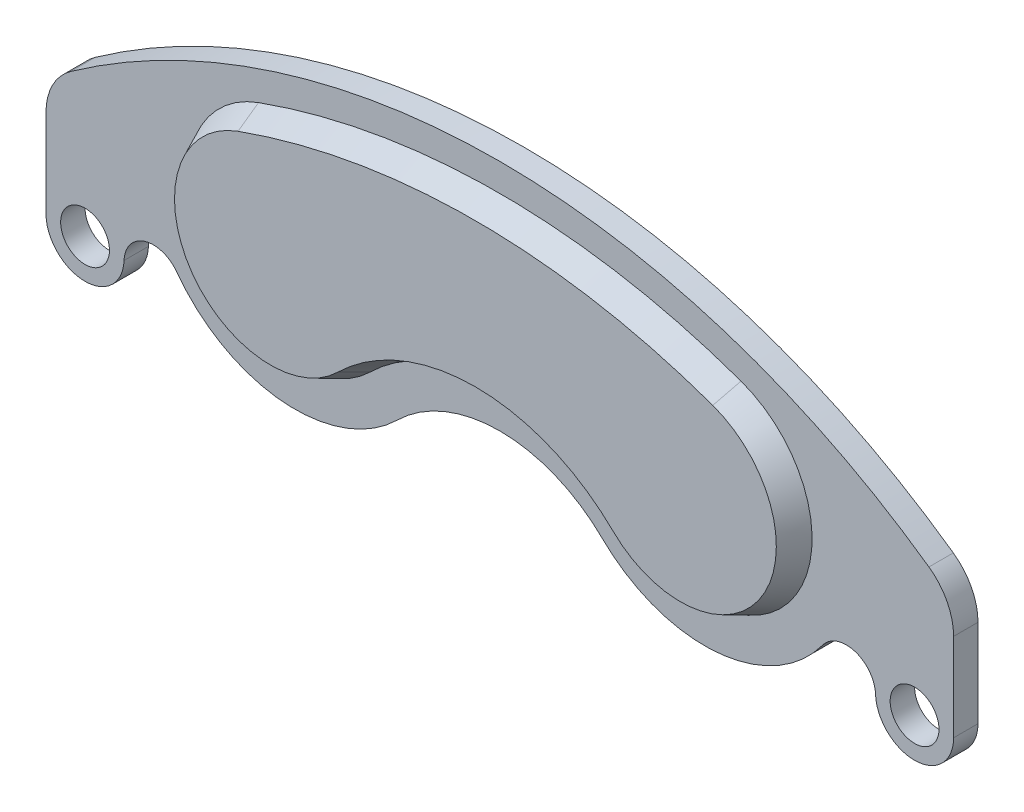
from build123d import *

# Parameters (mm, degrees)
BOSS_EXTRUDE1_DEPTH = 2.5
BOSS_EXTRUDE2_DEPTH = 2.5
BOSS_EXTRUDE2_TAPER = 25
SKETCH4_R           = 2.5
CUT_EXTRUDE1_DEPTH  = 90.131924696


with BuildPart() as part:
    # Sketch1 → Boss-Extrude1 (new body)
    with BuildSketch(Plane.XY):
        with BuildLine():
            Line((-46.5, 57.094220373), (-46.5, 48.094220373))
            ThreePointArc((-46.5, 48.094220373), (-42.572396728, 44.094875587), (-38.502620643, 47.949450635))
            ThreePointArc((-38.502620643, 47.949450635), (-36.387640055, 50.707965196), (-33.087155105, 49.617394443))
            ThreePointArc((-33.087155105, 49.617394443), (-22.211018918, 43.548965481), (-10.5, 47.787857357))
            ThreePointArc((-10.5, 47.787857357), (0, 52.075714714), (10.5, 47.787857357))
            ThreePointArc((10.5, 47.787857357), (22.211018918, 43.548965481), (33.087155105, 49.617394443))
            ThreePointArc((33.087155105, 49.617394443), (36.387640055, 50.707965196), (38.502620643, 47.949450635))
            ThreePointArc((38.502620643, 47.949450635), (42.572396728, 44.094875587), (46.5, 48.094220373))
            Line((46.5, 48.094220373), (46.5, 57.094220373))
            ThreePointArc((46.5, 57.094220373), (45.830505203, 59.848437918), (43.971428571, 61.988010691))
            ThreePointArc((43.971428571, 61.988010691), (0, 76), (-43.971428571, 61.988010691))
            ThreePointArc((-43.971428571, 61.988010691), (-45.830505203, 59.848437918), (-46.5, 57.094220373))
        make_face()
    extrude(amount=BOSS_EXTRUDE1_DEPTH)

    # Sketch3 → Boss-Extrude2 (add)
    with BuildSketch(Plane.XY.offset(2.5)):
        with BuildLine():
            ThreePointArc((24.71651229, 68.853141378), (0, 73.155048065), (-24.71651229, 68.853141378))
            ThreePointArc((-24.71651229, 68.853141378), (-30.319675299, 52.656743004), (-13.3, 50.644428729))
            ThreePointArc((-13.3, 50.644428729), (0, 56.075714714), (13.3, 50.644428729))
            ThreePointArc((13.3, 50.644428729), (30.319675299, 52.656743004), (24.71651229, 68.853141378))
        make_face()
    extrude(amount=BOSS_EXTRUDE2_DEPTH, taper=BOSS_EXTRUDE2_TAPER)

    # Sketch4 → Cut-Extrude1 (cut, through all)
    with BuildSketch(Plane.XY.offset(2.5)):
        with Locations((-42.5, 48.094220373)):
            Circle(SKETCH4_R)
        with Locations((42.5, 48.094220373)):
            Circle(SKETCH4_R)
    extrude(amount=-CUT_EXTRUDE1_DEPTH, mode=Mode.SUBTRACT)


solid = part.part
